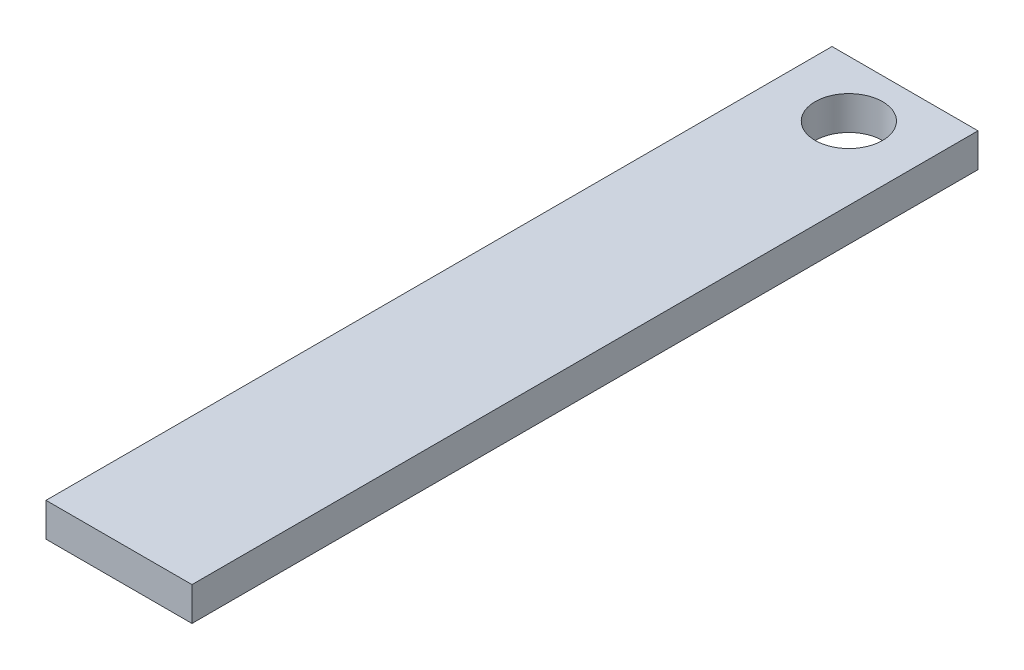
ISO-10303-21;
HEADER;
FILE_DESCRIPTION(('STEP AP214'),'2;1');
FILE_NAME('part.step','',(''),(''),'','','');
FILE_SCHEMA(('AUTOMOTIVE_DESIGN { 1 0 10303 214 1 1 1 1 }'));
ENDSEC;
DATA;
#1=APPLICATION_CONTEXT('core data for automotive mechanical design processes');
#2=APPLICATION_PROTOCOL_DEFINITION('international standard','automotive_design',2000,#1);
#3=PRODUCT_CONTEXT('',#1,'mechanical');
#4=PRODUCT('Part','Part','',(#3));
#5=PRODUCT_RELATED_PRODUCT_CATEGORY('part','',(#4));
#6=PRODUCT_DEFINITION_FORMATION('','',#4);
#7=PRODUCT_DEFINITION_CONTEXT('part definition',#1,'design');
#8=PRODUCT_DEFINITION('design','',#6,#7);
#9=PRODUCT_DEFINITION_SHAPE('','',#8);
#10=(LENGTH_UNIT() NAMED_UNIT(*) SI_UNIT(.MILLI.,.METRE.));
#11=(NAMED_UNIT(*) PLANE_ANGLE_UNIT() SI_UNIT($,.RADIAN.));
#12=(NAMED_UNIT(*) SI_UNIT($,.STERADIAN.) SOLID_ANGLE_UNIT());
#13=UNCERTAINTY_MEASURE_WITH_UNIT(LENGTH_MEASURE(1.E-05),#10,'distance_accuracy_value','');
#14=(GEOMETRIC_REPRESENTATION_CONTEXT(3) GLOBAL_UNCERTAINTY_ASSIGNED_CONTEXT((#13)) GLOBAL_UNIT_ASSIGNED_CONTEXT((#10,
#11,#12)) REPRESENTATION_CONTEXT('',''));
#15=CARTESIAN_POINT('',(0.,0.,0.));
#16=DIRECTION('',(0.,0.,1.));
#17=DIRECTION('',(1.,0.,0.));
#18=AXIS2_PLACEMENT_3D('',#15,#16,#17);
#19=CARTESIAN_POINT('',(0.,0.,0.));
#20=DIRECTION('',(0.,1.,0.));
#21=DIRECTION('',(0.,0.,1.));
#22=AXIS2_PLACEMENT_3D('',#19,#20,#21);
#23=PLANE('',#22);
#24=DIRECTION('',(-1.,0.,0.));
#25=VECTOR('',#24,1.);
#26=CARTESIAN_POINT('',(-6.5,0.,35.));
#27=LINE('',#26,#25);
#28=CARTESIAN_POINT('',(6.5,0.,35.));
#29=VERTEX_POINT('',#28);
#30=CARTESIAN_POINT('',(-6.5,0.,35.));
#31=VERTEX_POINT('',#30);
#32=EDGE_CURVE('E84',#29,#31,#27,.T.);
#33=ORIENTED_EDGE('',*,*,#32,.T.);
#34=DIRECTION('',(0.,0.,-1.));
#35=VECTOR('',#34,1.);
#36=CARTESIAN_POINT('',(-6.50000000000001,0.,-35.));
#37=LINE('',#36,#35);
#38=CARTESIAN_POINT('',(-6.50000000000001,0.,-35.));
#39=VERTEX_POINT('',#38);
#40=EDGE_CURVE('E71',#31,#39,#37,.T.);
#41=ORIENTED_EDGE('',*,*,#40,.T.);
#42=DIRECTION('',(1.,0.,0.));
#43=VECTOR('',#42,1.);
#44=CARTESIAN_POINT('',(-6.50000000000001,0.,-35.));
#45=LINE('',#44,#43);
#46=CARTESIAN_POINT('',(6.5,0.,-35.));
#47=VERTEX_POINT('',#46);
#48=EDGE_CURVE('E55',#39,#47,#45,.T.);
#49=ORIENTED_EDGE('',*,*,#48,.T.);
#50=DIRECTION('',(0.,0.,1.));
#51=VECTOR('',#50,1.);
#52=CARTESIAN_POINT('',(6.5,0.,-35.));
#53=LINE('',#52,#51);
#54=EDGE_CURVE('E60',#47,#29,#53,.T.);
#55=ORIENTED_EDGE('',*,*,#54,.T.);
#56=EDGE_LOOP('',(#33,#41,#49,#55));
#57=FACE_BOUND('',#56,.T.);
#58=CARTESIAN_POINT('',(0.,0.,-30.));
#59=DIRECTION('',(0.,-1.,0.));
#60=DIRECTION('',(0.,0.,-1.));
#61=AXIS2_PLACEMENT_3D('',#58,#59,#60);
#62=CIRCLE('',#61,3.00000000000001);
#63=CARTESIAN_POINT('',(0.,0.,-33.));
#64=VERTEX_POINT('',#63);
#65=EDGE_CURVE('E20',#64,#64,#62,.F.);
#66=ORIENTED_EDGE('',*,*,#65,.T.);
#67=EDGE_LOOP('',(#66));
#68=FACE_BOUND('',#67,.T.);
#69=ADVANCED_FACE('F17',(#57,#68),#23,.F.);
#70=CARTESIAN_POINT('',(0.,3.,-30.));
#71=DIRECTION('',(0.,-1.,0.));
#72=DIRECTION('',(0.,0.,-1.));
#73=AXIS2_PLACEMENT_3D('',#70,#71,#72);
#74=CYLINDRICAL_SURFACE('',#73,3.00000000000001);
#75=ORIENTED_EDGE('',*,*,#65,.F.);
#76=EDGE_LOOP('',(#75));
#77=FACE_BOUND('',#76,.T.);
#78=CARTESIAN_POINT('',(0.,3.,-30.));
#79=DIRECTION('',(0.,-1.,0.));
#80=DIRECTION('',(0.,0.,-1.));
#81=AXIS2_PLACEMENT_3D('',#78,#79,#80);
#82=CIRCLE('',#81,3.00000000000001);
#83=CARTESIAN_POINT('',(0.,3.,-33.));
#84=VERTEX_POINT('',#83);
#85=EDGE_CURVE('E81',#84,#84,#82,.T.);
#86=ORIENTED_EDGE('',*,*,#85,.F.);
#87=EDGE_LOOP('',(#86));
#88=FACE_BOUND('',#87,.T.);
#89=ADVANCED_FACE('F113',(#77,#88),#74,.F.);
#90=CARTESIAN_POINT('',(6.5,3.,-35.));
#91=DIRECTION('',(-1.,0.,0.));
#92=DIRECTION('',(0.,0.,1.));
#93=AXIS2_PLACEMENT_3D('',#90,#91,#92);
#94=PLANE('',#93);
#95=DIRECTION('',(0.,1.,0.));
#96=VECTOR('',#95,1.);
#97=CARTESIAN_POINT('',(6.5,3.,-35.));
#98=LINE('',#97,#96);
#99=CARTESIAN_POINT('',(6.5,3.,-35.));
#100=VERTEX_POINT('',#99);
#101=EDGE_CURVE('E62',#47,#100,#98,.T.);
#102=ORIENTED_EDGE('',*,*,#101,.T.);
#103=DIRECTION('',(0.,0.,1.));
#104=VECTOR('',#103,1.);
#105=CARTESIAN_POINT('',(6.50000000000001,3.,0.));
#106=LINE('',#105,#104);
#107=CARTESIAN_POINT('',(6.5,3.,35.));
#108=VERTEX_POINT('',#107);
#109=EDGE_CURVE('E83',#108,#100,#106,.F.);
#110=ORIENTED_EDGE('',*,*,#109,.F.);
#111=DIRECTION('',(0.,1.,0.));
#112=VECTOR('',#111,1.);
#113=CARTESIAN_POINT('',(6.50000000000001,3.,35.));
#114=LINE('',#113,#112);
#115=EDGE_CURVE('E65',#108,#29,#114,.F.);
#116=ORIENTED_EDGE('',*,*,#115,.T.);
#117=ORIENTED_EDGE('',*,*,#54,.F.);
#118=EDGE_LOOP('',(#102,#110,#116,#117));
#119=FACE_BOUND('',#118,.T.);
#120=ADVANCED_FACE('F61',(#119),#94,.F.);
#121=CARTESIAN_POINT('',(-6.50000000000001,3.,-35.));
#122=DIRECTION('',(0.,0.,1.));
#123=DIRECTION('',(1.,0.,0.));
#124=AXIS2_PLACEMENT_3D('',#121,#122,#123);
#125=PLANE('',#124);
#126=DIRECTION('',(0.,1.,0.));
#127=VECTOR('',#126,1.);
#128=CARTESIAN_POINT('',(-6.50000000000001,3.,-35.));
#129=LINE('',#128,#127);
#130=CARTESIAN_POINT('',(-6.50000000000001,3.,-35.));
#131=VERTEX_POINT('',#130);
#132=EDGE_CURVE('E73',#39,#131,#129,.T.);
#133=ORIENTED_EDGE('',*,*,#132,.T.);
#134=DIRECTION('',(1.,0.,0.));
#135=VECTOR('',#134,1.);
#136=CARTESIAN_POINT('',(0.,3.,-35.));
#137=LINE('',#136,#135);
#138=EDGE_CURVE('E77',#100,#131,#137,.F.);
#139=ORIENTED_EDGE('',*,*,#138,.F.);
#140=ORIENTED_EDGE('',*,*,#101,.F.);
#141=ORIENTED_EDGE('',*,*,#48,.F.);
#142=EDGE_LOOP('',(#133,#139,#140,#141));
#143=FACE_BOUND('',#142,.T.);
#144=ADVANCED_FACE('F75',(#143),#125,.F.);
#145=CARTESIAN_POINT('',(-6.50000000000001,3.,-35.));
#146=DIRECTION('',(1.,0.,0.));
#147=DIRECTION('',(0.,0.,-1.));
#148=AXIS2_PLACEMENT_3D('',#145,#146,#147);
#149=PLANE('',#148);
#150=DIRECTION('',(0.,1.,0.));
#151=VECTOR('',#150,1.);
#152=CARTESIAN_POINT('',(-6.5,3.,35.));
#153=LINE('',#152,#151);
#154=CARTESIAN_POINT('',(-6.5,3.,35.));
#155=VERTEX_POINT('',#154);
#156=EDGE_CURVE('E35',#31,#155,#153,.T.);
#157=ORIENTED_EDGE('',*,*,#156,.T.);
#158=DIRECTION('',(0.,0.,1.));
#159=VECTOR('',#158,1.);
#160=CARTESIAN_POINT('',(-6.50000000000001,3.,0.));
#161=LINE('',#160,#159);
#162=EDGE_CURVE('E26',#131,#155,#161,.T.);
#163=ORIENTED_EDGE('',*,*,#162,.F.);
#164=ORIENTED_EDGE('',*,*,#132,.F.);
#165=ORIENTED_EDGE('',*,*,#40,.F.);
#166=EDGE_LOOP('',(#157,#163,#164,#165));
#167=FACE_BOUND('',#166,.T.);
#168=ADVANCED_FACE('F94',(#167),#149,.F.);
#169=CARTESIAN_POINT('',(-6.5,3.,35.));
#170=DIRECTION('',(0.,0.,-1.));
#171=DIRECTION('',(-1.,0.,0.));
#172=AXIS2_PLACEMENT_3D('',#169,#170,#171);
#173=PLANE('',#172);
#174=ORIENTED_EDGE('',*,*,#115,.F.);
#175=DIRECTION('',(1.,0.,0.));
#176=VECTOR('',#175,1.);
#177=CARTESIAN_POINT('',(0.,3.,35.));
#178=LINE('',#177,#176);
#179=EDGE_CURVE('E11',#155,#108,#178,.T.);
#180=ORIENTED_EDGE('',*,*,#179,.F.);
#181=ORIENTED_EDGE('',*,*,#156,.F.);
#182=ORIENTED_EDGE('',*,*,#32,.F.);
#183=EDGE_LOOP('',(#174,#180,#181,#182));
#184=FACE_BOUND('',#183,.T.);
#185=ADVANCED_FACE('F99',(#184),#173,.F.);
#186=CARTESIAN_POINT('',(0.,3.,0.));
#187=DIRECTION('',(0.,1.,0.));
#188=DIRECTION('',(0.,0.,1.));
#189=AXIS2_PLACEMENT_3D('',#186,#187,#188);
#190=PLANE('',#189);
#191=ORIENTED_EDGE('',*,*,#162,.T.);
#192=ORIENTED_EDGE('',*,*,#179,.T.);
#193=ORIENTED_EDGE('',*,*,#109,.T.);
#194=ORIENTED_EDGE('',*,*,#138,.T.);
#195=EDGE_LOOP('',(#191,#192,#193,#194));
#196=FACE_BOUND('',#195,.T.);
#197=ORIENTED_EDGE('',*,*,#85,.T.);
#198=EDGE_LOOP('',(#197));
#199=FACE_BOUND('',#198,.T.);
#200=ADVANCED_FACE('F97',(#196,#199),#190,.T.);
#201=CLOSED_SHELL('',(#69,#89,#120,#144,#168,#185,#200));
#202=MANIFOLD_SOLID_BREP('B1',#201);
#203=ADVANCED_BREP_SHAPE_REPRESENTATION('',(#18,#202),#14);
#204=SHAPE_DEFINITION_REPRESENTATION(#9,#203);
ENDSEC;
END-ISO-10303-21;
